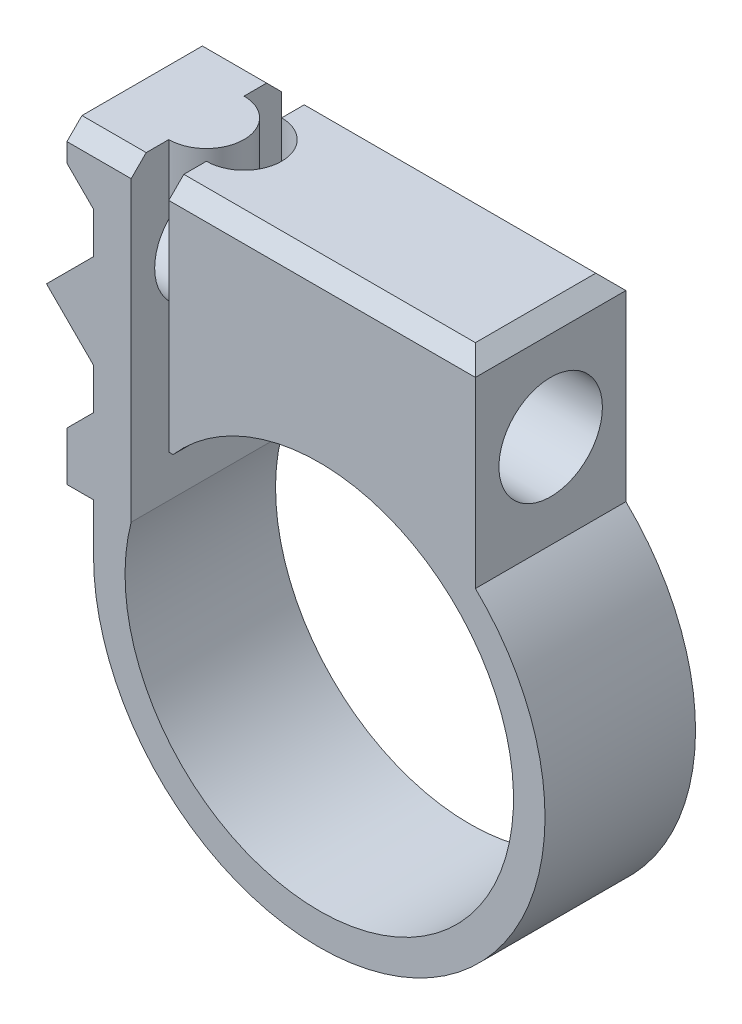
ISO-10303-21;
HEADER;
FILE_DESCRIPTION(('STEP AP214'),'2;1');
FILE_NAME('part.step','',(''),(''),'','','');
FILE_SCHEMA(('AUTOMOTIVE_DESIGN { 1 0 10303 214 1 1 1 1 }'));
ENDSEC;
DATA;
#1=APPLICATION_CONTEXT('core data for automotive mechanical design processes');
#2=APPLICATION_PROTOCOL_DEFINITION('international standard','automotive_design',2000,#1);
#3=PRODUCT_CONTEXT('',#1,'mechanical');
#4=PRODUCT('Part','Part','',(#3));
#5=PRODUCT_RELATED_PRODUCT_CATEGORY('part','',(#4));
#6=PRODUCT_DEFINITION_FORMATION('','',#4);
#7=PRODUCT_DEFINITION_CONTEXT('part definition',#1,'design');
#8=PRODUCT_DEFINITION('design','',#6,#7);
#9=PRODUCT_DEFINITION_SHAPE('','',#8);
#10=(LENGTH_UNIT() NAMED_UNIT(*) SI_UNIT(.MILLI.,.METRE.));
#11=(NAMED_UNIT(*) PLANE_ANGLE_UNIT() SI_UNIT($,.RADIAN.));
#12=(NAMED_UNIT(*) SI_UNIT($,.STERADIAN.) SOLID_ANGLE_UNIT());
#13=UNCERTAINTY_MEASURE_WITH_UNIT(LENGTH_MEASURE(1.E-05),#10,'distance_accuracy_value','');
#14=(GEOMETRIC_REPRESENTATION_CONTEXT(3) GLOBAL_UNCERTAINTY_ASSIGNED_CONTEXT((#13)) GLOBAL_UNIT_ASSIGNED_CONTEXT((#10,
#11,#12)) REPRESENTATION_CONTEXT('',''));
#15=CARTESIAN_POINT('',(0.,0.,0.));
#16=DIRECTION('',(0.,0.,1.));
#17=DIRECTION('',(1.,0.,0.));
#18=AXIS2_PLACEMENT_3D('',#15,#16,#17);
#19=CARTESIAN_POINT('',(-3.49250000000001,1.89597438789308,-34.0467024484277));
#20=DIRECTION('',(0.,1.,0.));
#21=DIRECTION('',(-1.,0.,0.));
#22=AXIS2_PLACEMENT_3D('',#19,#20,#21);
#23=CYLINDRICAL_SURFACE('',#22,2.54);
#24=DIRECTION('',(0.,1.,0.));
#25=VECTOR('',#24,1.);
#26=CARTESIAN_POINT('',(-3.4925,1.89597438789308,-36.5867024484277));
#27=LINE('',#26,#25);
#28=CARTESIAN_POINT('',(-3.49249999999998,1.89597438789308,-36.5867024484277));
#29=VERTEX_POINT('',#28);
#30=CARTESIAN_POINT('',(-3.49249999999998,4.05497438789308,-36.5867024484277));
#31=VERTEX_POINT('',#30);
#32=EDGE_CURVE('E275',#29,#31,#27,.T.);
#33=ORIENTED_EDGE('',*,*,#32,.T.);
#34=CARTESIAN_POINT('',(-3.49250000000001,4.05497438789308,-34.0467024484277));
#35=DIRECTION('',(0.,1.,0.));
#36=DIRECTION('',(-1.,0.,0.));
#37=AXIS2_PLACEMENT_3D('',#34,#35,#36);
#38=CIRCLE('',#37,2.54);
#39=CARTESIAN_POINT('',(-3.49250000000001,4.05497438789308,-31.5067024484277));
#40=VERTEX_POINT('',#39);
#41=EDGE_CURVE('E267',#40,#31,#38,.T.);
#42=ORIENTED_EDGE('',*,*,#41,.F.);
#43=DIRECTION('',(0.,1.,0.));
#44=VECTOR('',#43,1.);
#45=CARTESIAN_POINT('',(-3.49250000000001,1.89597438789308,-31.5067024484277));
#46=LINE('',#45,#44);
#47=CARTESIAN_POINT('',(-3.4925,1.89597438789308,-31.5067024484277));
#48=VERTEX_POINT('',#47);
#49=EDGE_CURVE('E277',#48,#40,#46,.T.);
#50=ORIENTED_EDGE('',*,*,#49,.F.);
#51=CARTESIAN_POINT('',(-3.49250000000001,1.89597438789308,-34.0467024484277));
#52=DIRECTION('',(0.,1.,0.));
#53=DIRECTION('',(1.,0.,0.));
#54=AXIS2_PLACEMENT_3D('',#51,#52,#53);
#55=CIRCLE('',#54,2.54);
#56=EDGE_CURVE('E282',#48,#29,#55,.T.);
#57=ORIENTED_EDGE('',*,*,#56,.T.);
#58=EDGE_LOOP('',(#33,#42,#50,#57));
#59=FACE_BOUND('',#58,.T.);
#60=ADVANCED_FACE('F53',(#59),#23,.T.);
#61=CARTESIAN_POINT('',(-3.49250000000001,11.0653743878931,-34.0467024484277));
#62=DIRECTION('',(0.,1.,0.));
#63=DIRECTION('',(-1.,0.,0.));
#64=AXIS2_PLACEMENT_3D('',#61,#62,#63);
#65=CIRCLE('',#64,2.54);
#66=CARTESIAN_POINT('',(-3.49250000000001,11.0653743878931,-31.5067024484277));
#67=VERTEX_POINT('',#66);
#68=CARTESIAN_POINT('',(-3.49249999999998,11.0653743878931,-36.5867024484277));
#69=VERTEX_POINT('',#68);
#70=EDGE_CURVE('E1064',#67,#69,#65,.T.);
#71=ORIENTED_EDGE('',*,*,#70,.T.);
#72=CARTESIAN_POINT('',(-3.49249999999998,14.5959743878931,-36.5867024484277));
#73=VERTEX_POINT('',#72);
#74=EDGE_CURVE('E285',#69,#73,#27,.T.);
#75=ORIENTED_EDGE('',*,*,#74,.T.);
#76=CARTESIAN_POINT('',(-3.49250000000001,14.5959743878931,-34.0467024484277));
#77=DIRECTION('',(0.,1.,0.));
#78=DIRECTION('',(1.,0.,0.));
#79=AXIS2_PLACEMENT_3D('',#76,#77,#78);
#80=CIRCLE('',#79,2.54);
#81=CARTESIAN_POINT('',(-3.49250000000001,14.5959743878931,-31.5067024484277));
#82=VERTEX_POINT('',#81);
#83=EDGE_CURVE('E279',#82,#73,#80,.T.);
#84=ORIENTED_EDGE('',*,*,#83,.F.);
#85=EDGE_CURVE('E284',#67,#82,#46,.T.);
#86=ORIENTED_EDGE('',*,*,#85,.F.);
#87=EDGE_LOOP('',(#71,#75,#84,#86));
#88=FACE_BOUND('',#87,.T.);
#89=ADVANCED_FACE('F374',(#88),#23,.T.);
#90=CARTESIAN_POINT('',(-6.03250000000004,7.75067438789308,-19.3271866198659));
#91=DIRECTION('',(0.707106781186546,-0.707106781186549,0.));
#92=DIRECTION('',(0.707106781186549,0.707106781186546,0.));
#93=AXIS2_PLACEMENT_3D('',#90,#91,#92);
#94=PLANE('',#93);
#95=DIRECTION('',(0.,0.,-1.));
#96=VECTOR('',#95,1.);
#97=CARTESIAN_POINT('',(-9.20750000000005,4.57567438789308,-19.3271866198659));
#98=LINE('',#97,#96);
#99=CARTESIAN_POINT('',(-9.20750000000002,4.57567438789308,-28.9667024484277));
#100=VERTEX_POINT('',#99);
#101=CARTESIAN_POINT('',(-9.20750000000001,4.57567438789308,-32.2267478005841));
#102=VERTEX_POINT('',#101);
#103=EDGE_CURVE('E921',#100,#102,#98,.T.);
#104=ORIENTED_EDGE('',*,*,#103,.F.);
#105=DIRECTION('',(0.707106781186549,0.707106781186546,0.));
#106=VECTOR('',#105,1.);
#107=CARTESIAN_POINT('',(-6.03250000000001,7.75067438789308,-28.9667024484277));
#108=LINE('',#107,#106);
#109=CARTESIAN_POINT('',(-6.03250000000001,7.75067438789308,-28.9667024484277));
#110=VERTEX_POINT('',#109);
#111=EDGE_CURVE('E842',#100,#110,#108,.T.);
#112=ORIENTED_EDGE('',*,*,#111,.T.);
#113=DIRECTION('',(0.,0.,-1.));
#114=VECTOR('',#113,1.);
#115=CARTESIAN_POINT('',(-6.03250000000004,7.75067438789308,-19.3271866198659));
#116=LINE('',#115,#114);
#117=CARTESIAN_POINT('',(-6.0325,7.75067438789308,-30.5596044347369));
#118=VERTEX_POINT('',#117);
#119=EDGE_CURVE('E913',#110,#118,#116,.T.);
#120=ORIENTED_EDGE('',*,*,#119,.T.);
#121=CARTESIAN_POINT('',(-6.22667438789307,7.5565,-34.0467024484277));
#122=DIRECTION('',(0.707106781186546,-0.707106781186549,0.));
#123=DIRECTION('',(0.707106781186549,0.707106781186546,0.));
#124=AXIS2_PLACEMENT_3D('',#121,#122,#123);
#125=ELLIPSE('',#124,4.93914086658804,3.4925);
#126=EDGE_CURVE('E968',#118,#102,#125,.T.);
#127=ORIENTED_EDGE('',*,*,#126,.T.);
#128=EDGE_LOOP('',(#104,#112,#120,#127));
#129=FACE_BOUND('',#128,.T.);
#130=ADVANCED_FACE('F378',(#129),#94,.F.);
#131=CARTESIAN_POINT('',(-6.03250000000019,10.5229487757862,22.920435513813));
#132=DIRECTION('',(1.,0.,0.));
#133=DIRECTION('',(0.,1.,0.));
#134=AXIS2_PLACEMENT_3D('',#131,#132,#133);
#135=PLANE('',#134);
#136=DIRECTION('',(0.,0.,-1.));
#137=VECTOR('',#136,1.);
#138=CARTESIAN_POINT('',(-6.03250000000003,-1.3716,-23.8867024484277));
#139=LINE('',#138,#137);
#140=CARTESIAN_POINT('',(-6.03250000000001,-1.3716,-28.9667024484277));
#141=VERTEX_POINT('',#140);
#142=CARTESIAN_POINT('',(-6.03249999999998,-1.3716,-39.1267024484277));
#143=VERTEX_POINT('',#142);
#144=EDGE_CURVE('E940',#141,#143,#139,.T.);
#145=ORIENTED_EDGE('',*,*,#144,.F.);
#146=DIRECTION('',(0.,1.,0.));
#147=VECTOR('',#146,1.);
#148=CARTESIAN_POINT('',(-6.03250000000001,10.5229487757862,-28.9667024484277));
#149=LINE('',#148,#147);
#150=CARTESIAN_POINT('',(-6.03250000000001,1.40067438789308,-28.9667024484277));
#151=VERTEX_POINT('',#150);
#152=EDGE_CURVE('E834',#141,#151,#149,.T.);
#153=ORIENTED_EDGE('',*,*,#152,.T.);
#154=DIRECTION('',(0.,0.,-1.));
#155=VECTOR('',#154,1.);
#156=CARTESIAN_POINT('',(-6.03250000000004,1.40067438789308,-19.3271866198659));
#157=LINE('',#156,#155);
#158=CARTESIAN_POINT('',(-6.03249999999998,1.40067438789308,-39.1267024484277));
#159=VERTEX_POINT('',#158);
#160=EDGE_CURVE('E916',#151,#159,#157,.T.);
#161=ORIENTED_EDGE('',*,*,#160,.T.);
#162=DIRECTION('',(0.,-1.,0.));
#163=VECTOR('',#162,1.);
#164=CARTESIAN_POINT('',(-6.03249999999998,10.5229487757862,-39.1267024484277));
#165=LINE('',#164,#163);
#166=EDGE_CURVE('E776',#159,#143,#165,.T.);
#167=ORIENTED_EDGE('',*,*,#166,.T.);
#168=EDGE_LOOP('',(#145,#153,#161,#167));
#169=FACE_BOUND('',#168,.T.);
#170=ADVANCED_FACE('F534',(#169),#135,.F.);
#171=ORIENTED_EDGE('',*,*,#119,.F.);
#172=DIRECTION('',(0.,1.,0.));
#173=VECTOR('',#172,1.);
#174=CARTESIAN_POINT('',(-6.03250000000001,10.5229487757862,-28.9667024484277));
#175=LINE('',#174,#173);
#176=CARTESIAN_POINT('',(-6.03250000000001,10.5229487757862,-28.9667024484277));
#177=VERTEX_POINT('',#176);
#178=EDGE_CURVE('E846',#110,#177,#175,.T.);
#179=ORIENTED_EDGE('',*,*,#178,.T.);
#180=DIRECTION('',(0.,0.,-1.));
#181=VECTOR('',#180,1.);
#182=CARTESIAN_POINT('',(-6.03250000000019,10.5229487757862,22.920435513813));
#183=LINE('',#182,#181);
#184=CARTESIAN_POINT('',(-6.0325,10.5229487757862,-32.2034070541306));
#185=VERTEX_POINT('',#184);
#186=EDGE_CURVE('E953',#177,#185,#183,.T.);
#187=ORIENTED_EDGE('',*,*,#186,.T.);
#188=CARTESIAN_POINT('',(-6.03249999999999,7.5565,-34.0467024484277));
#189=DIRECTION('',(1.,0.,0.));
#190=DIRECTION('',(0.,1.,0.));
#191=AXIS2_PLACEMENT_3D('',#188,#189,#190);
#192=CIRCLE('',#191,3.4925);
#193=EDGE_CURVE('E902',#185,#118,#192,.T.);
#194=ORIENTED_EDGE('',*,*,#193,.T.);
#195=EDGE_LOOP('',(#171,#179,#187,#194));
#196=FACE_BOUND('',#195,.T.);
#197=ADVANCED_FACE('F566',(#196),#135,.F.);
#198=CARTESIAN_POINT('',(-6.03249999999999,10.5229487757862,-35.8899978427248));
#199=VERTEX_POINT('',#198);
#200=CARTESIAN_POINT('',(-6.03249999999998,10.5229487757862,-39.1267024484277));
#201=VERTEX_POINT('',#200);
#202=EDGE_CURVE('E952',#199,#201,#183,.T.);
#203=ORIENTED_EDGE('',*,*,#202,.T.);
#204=DIRECTION('',(0.,-1.,0.));
#205=VECTOR('',#204,1.);
#206=CARTESIAN_POINT('',(-6.03249999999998,10.5229487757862,-39.1267024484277));
#207=LINE('',#206,#205);
#208=CARTESIAN_POINT('',(-6.03249999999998,7.75067438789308,-39.1267024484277));
#209=VERTEX_POINT('',#208);
#210=EDGE_CURVE('E788',#201,#209,#207,.T.);
#211=ORIENTED_EDGE('',*,*,#210,.T.);
#212=CARTESIAN_POINT('',(-6.03249999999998,7.75067438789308,-37.5338004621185));
#213=VERTEX_POINT('',#212);
#214=EDGE_CURVE('E912',#213,#209,#116,.T.);
#215=ORIENTED_EDGE('',*,*,#214,.F.);
#216=CARTESIAN_POINT('',(-6.03249999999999,7.5565,-34.0467024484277));
#217=DIRECTION('',(1.,0.,0.));
#218=DIRECTION('',(0.,1.,0.));
#219=AXIS2_PLACEMENT_3D('',#216,#217,#218);
#220=CIRCLE('',#219,3.4925);
#221=EDGE_CURVE('E894',#213,#199,#220,.T.);
#222=ORIENTED_EDGE('',*,*,#221,.T.);
#223=EDGE_LOOP('',(#203,#211,#215,#222));
#224=FACE_BOUND('',#223,.T.);
#225=ADVANCED_FACE('F535',(#224),#135,.F.);
#226=CARTESIAN_POINT('',(-3.49250000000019,-9.76922715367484,22.9204355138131));
#227=DIRECTION('',(-1.,0.,0.));
#228=DIRECTION('',(0.,0.,1.));
#229=AXIS2_PLACEMENT_3D('',#226,#227,#228);
#230=PLANE('',#229);
#231=DIRECTION('',(0.,0.,1.));
#232=VECTOR('',#231,1.);
#233=CARTESIAN_POINT('',(-3.49249999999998,11.0653743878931,-36.5867024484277));
#234=LINE('',#233,#232);
#235=EDGE_CURVE('E272',#69,#67,#234,.T.);
#236=ORIENTED_EDGE('',*,*,#235,.T.);
#237=ORIENTED_EDGE('',*,*,#85,.T.);
#238=DIRECTION('',(0.,0.,1.));
#239=VECTOR('',#238,1.);
#240=CARTESIAN_POINT('',(-3.49250000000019,14.5959743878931,22.9204355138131));
#241=LINE('',#240,#239);
#242=CARTESIAN_POINT('',(-3.49250000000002,14.5959743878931,-29.9827024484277));
#243=VERTEX_POINT('',#242);
#244=EDGE_CURVE('E880',#82,#243,#241,.T.);
#245=ORIENTED_EDGE('',*,*,#244,.T.);
#246=DIRECTION('',(0.,-0.707106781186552,0.707106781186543));
#247=VECTOR('',#246,1.);
#248=CARTESIAN_POINT('',(-3.49250000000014,-24.0381953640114,8.65146730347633));
#249=LINE('',#248,#247);
#250=CARTESIAN_POINT('',(-3.49250000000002,13.5799743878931,-28.9667024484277));
#251=VERTEX_POINT('',#250);
#252=EDGE_CURVE('E736',#243,#251,#249,.T.);
#253=ORIENTED_EDGE('',*,*,#252,.T.);
#254=DIRECTION('',(0.,-1.,0.));
#255=VECTOR('',#254,1.);
#256=CARTESIAN_POINT('',(-3.49250000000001,-9.76922715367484,-28.9667024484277));
#257=LINE('',#256,#255);
#258=CARTESIAN_POINT('',(-3.49250000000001,-6.50514802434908,-28.9667024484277));
#259=VERTEX_POINT('',#258);
#260=EDGE_CURVE('E858',#251,#259,#257,.T.);
#261=ORIENTED_EDGE('',*,*,#260,.T.);
#262=DIRECTION('',(0.,0.,-1.));
#263=VECTOR('',#262,1.);
#264=CARTESIAN_POINT('',(-3.49250000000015,-6.50514802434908,10.6617553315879));
#265=LINE('',#264,#263);
#266=CARTESIAN_POINT('',(-3.49249999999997,-6.50514802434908,-39.1267024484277));
#267=VERTEX_POINT('',#266);
#268=EDGE_CURVE('E929',#267,#259,#265,.F.);
#269=ORIENTED_EDGE('',*,*,#268,.F.);
#270=DIRECTION('',(0.,1.,0.));
#271=VECTOR('',#270,1.);
#272=CARTESIAN_POINT('',(-3.49249999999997,-9.76922715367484,-39.1267024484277));
#273=LINE('',#272,#271);
#274=CARTESIAN_POINT('',(-3.49249999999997,13.5799743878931,-39.1267024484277));
#275=VERTEX_POINT('',#274);
#276=EDGE_CURVE('E799',#267,#275,#273,.T.);
#277=ORIENTED_EDGE('',*,*,#276,.T.);
#278=DIRECTION('',(0.,0.707106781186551,0.707106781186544));
#279=VECTOR('',#278,1.);
#280=CARTESIAN_POINT('',(-3.49250000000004,32.9289425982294,-19.7777342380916));
#281=LINE('',#280,#279);
#282=CARTESIAN_POINT('',(-3.49249999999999,14.5959743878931,-38.1107024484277));
#283=VERTEX_POINT('',#282);
#284=EDGE_CURVE('E751',#275,#283,#281,.T.);
#285=ORIENTED_EDGE('',*,*,#284,.T.);
#286=EDGE_CURVE('E881',#283,#73,#241,.T.);
#287=ORIENTED_EDGE('',*,*,#286,.T.);
#288=ORIENTED_EDGE('',*,*,#74,.F.);
#289=EDGE_LOOP('',(#236,#237,#245,#253,#261,#269,#277,#285,#287,#288));
#290=FACE_BOUND('',#289,.T.);
#291=CARTESIAN_POINT('',(-3.49249999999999,7.5565,-34.0467024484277));
#292=DIRECTION('',(-1.,0.,0.));
#293=DIRECTION('',(0.,0.,1.));
#294=AXIS2_PLACEMENT_3D('',#291,#292,#293);
#295=CIRCLE('',#294,3.4925);
#296=CARTESIAN_POINT('',(-3.4925,7.5565,-30.5542024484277));
#297=VERTEX_POINT('',#296);
#298=EDGE_CURVE('E908',#297,#297,#295,.T.);
#299=ORIENTED_EDGE('',*,*,#298,.T.);
#300=EDGE_LOOP('',(#299));
#301=FACE_BOUND('',#300,.T.);
#302=ORIENTED_EDGE('',*,*,#49,.T.);
#303=DIRECTION('',(0.,0.,1.));
#304=VECTOR('',#303,1.);
#305=CARTESIAN_POINT('',(-3.49249999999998,4.05497438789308,-36.5867024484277));
#306=LINE('',#305,#304);
#307=EDGE_CURVE('E68',#31,#40,#306,.T.);
#308=ORIENTED_EDGE('',*,*,#307,.F.);
#309=ORIENTED_EDGE('',*,*,#32,.F.);
#310=DIRECTION('',(0.,0.,1.));
#311=VECTOR('',#310,1.);
#312=CARTESIAN_POINT('',(-3.49250000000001,1.89597438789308,-31.5067024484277));
#313=LINE('',#312,#311);
#314=EDGE_CURVE('E76',#29,#48,#313,.T.);
#315=ORIENTED_EDGE('',*,*,#314,.T.);
#316=EDGE_LOOP('',(#302,#308,#309,#315));
#317=FACE_BOUND('',#316,.T.);
#318=ADVANCED_FACE('F274',(#290,#301,#317),#230,.F.);
#319=CARTESIAN_POINT('',(-0.104111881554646,-1.13303099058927,22.9204355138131));
#320=DIRECTION('',(-0.00227071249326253,0.999997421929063,0.));
#321=DIRECTION('',(0.,0.,-1.));
#322=AXIS2_PLACEMENT_3D('',#319,#320,#321);
#323=PLANE('',#322);
#324=DIRECTION('',(-0.999997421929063,-0.00227071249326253,0.));
#325=VECTOR('',#324,1.);
#326=CARTESIAN_POINT('',(-0.104111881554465,-1.13303099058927,-28.9667024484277));
#327=LINE('',#326,#325);
#328=CARTESIAN_POINT('',(-0.952500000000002,-1.13495744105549,-28.9667024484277));
#329=VERTEX_POINT('',#328);
#330=CARTESIAN_POINT('',(-0.660739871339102,-1.13429493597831,-28.9667024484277));
#331=VERTEX_POINT('',#330);
#332=EDGE_CURVE('E865',#329,#331,#327,.F.);
#333=ORIENTED_EDGE('',*,*,#332,.F.);
#334=DIRECTION('',(0.,0.,1.));
#335=VECTOR('',#334,1.);
#336=CARTESIAN_POINT('',(-0.952500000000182,-1.13495744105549,22.9204355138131));
#337=LINE('',#336,#335);
#338=CARTESIAN_POINT('',(-0.952499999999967,-1.13495744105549,-39.1267024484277));
#339=VERTEX_POINT('',#338);
#340=EDGE_CURVE('E956',#339,#329,#337,.T.);
#341=ORIENTED_EDGE('',*,*,#340,.F.);
#342=DIRECTION('',(0.999997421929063,0.00227071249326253,0.));
#343=VECTOR('',#342,1.);
#344=CARTESIAN_POINT('',(-0.104111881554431,-1.13303099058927,-39.1267024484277));
#345=LINE('',#344,#343);
#346=CARTESIAN_POINT('',(-0.660739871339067,-1.13429493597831,-39.1267024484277));
#347=VERTEX_POINT('',#346);
#348=EDGE_CURVE('E806',#347,#339,#345,.F.);
#349=ORIENTED_EDGE('',*,*,#348,.F.);
#350=DIRECTION('',(0.,0.,-1.));
#351=VECTOR('',#350,1.);
#352=CARTESIAN_POINT('',(-0.660739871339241,-1.13429493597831,10.6617553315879));
#353=LINE('',#352,#351);
#354=EDGE_CURVE('E960',#347,#331,#353,.F.);
#355=ORIENTED_EDGE('',*,*,#354,.T.);
#356=EDGE_LOOP('',(#333,#341,#349,#355));
#357=FACE_BOUND('',#356,.T.);
#358=ADVANCED_FACE('F542',(#357),#323,.F.);
#359=CARTESIAN_POINT('',(9.20749999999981,-9.76922715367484,22.9204355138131));
#360=DIRECTION('',(0.,0.,-1.));
#361=DIRECTION('',(-1.,0.,0.));
#362=AXIS2_PLACEMENT_3D('',#359,#360,#361);
#363=CYLINDRICAL_SURFACE('',#362,15.24);
#364=CARTESIAN_POINT('',(9.20749999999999,-9.76922715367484,-28.9667024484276));
#365=DIRECTION('',(0.,0.,-1.));
#366=DIRECTION('',(-1.,0.,0.));
#367=AXIS2_PLACEMENT_3D('',#364,#365,#366);
#368=CIRCLE('',#367,15.24);
#369=CARTESIAN_POINT('',(19.7485,1.23735810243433,-28.9667024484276));
#370=VERTEX_POINT('',#369);
#371=CARTESIAN_POINT('',(-6.03250000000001,-9.76922715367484,-28.9667024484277));
#372=VERTEX_POINT('',#371);
#373=EDGE_CURVE('E817',#370,#372,#368,.T.);
#374=ORIENTED_EDGE('',*,*,#373,.T.);
#375=DIRECTION('',(0.,0.,-1.));
#376=VECTOR('',#375,1.);
#377=CARTESIAN_POINT('',(-6.03250000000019,-9.76922715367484,22.920435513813));
#378=LINE('',#377,#376);
#379=CARTESIAN_POINT('',(-6.03249999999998,-9.76922715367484,-39.1267024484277));
#380=VERTEX_POINT('',#379);
#381=EDGE_CURVE('E948',#372,#380,#378,.T.);
#382=ORIENTED_EDGE('',*,*,#381,.T.);
#383=CARTESIAN_POINT('',(9.20750000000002,-9.76922715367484,-39.1267024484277));
#384=DIRECTION('',(0.,0.,1.));
#385=DIRECTION('',(1.,0.,0.));
#386=AXIS2_PLACEMENT_3D('',#383,#384,#385);
#387=CIRCLE('',#386,15.24);
#388=CARTESIAN_POINT('',(19.7485,1.23735810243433,-39.1267024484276));
#389=VERTEX_POINT('',#388);
#390=EDGE_CURVE('E759',#380,#389,#387,.T.);
#391=ORIENTED_EDGE('',*,*,#390,.T.);
#392=DIRECTION('',(0.,0.,-1.));
#393=VECTOR('',#392,1.);
#394=CARTESIAN_POINT('',(19.7484999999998,1.23735810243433,22.9204355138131));
#395=LINE('',#394,#393);
#396=EDGE_CURVE('E969',#389,#370,#395,.F.);
#397=ORIENTED_EDGE('',*,*,#396,.T.);
#398=EDGE_LOOP('',(#374,#382,#391,#397));
#399=FACE_BOUND('',#398,.T.);
#400=ADVANCED_FACE('F531',(#399),#363,.T.);
#401=ORIENTED_EDGE('',*,*,#381,.F.);
#402=DIRECTION('',(0.,1.,0.));
#403=VECTOR('',#402,1.);
#404=CARTESIAN_POINT('',(-6.03250000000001,10.5229487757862,-28.9667024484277));
#405=LINE('',#404,#403);
#406=CARTESIAN_POINT('',(-6.03250000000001,-6.46843918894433,-28.9667024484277));
#407=VERTEX_POINT('',#406);
#408=EDGE_CURVE('E820',#372,#407,#405,.T.);
#409=ORIENTED_EDGE('',*,*,#408,.T.);
#410=DIRECTION('',(0.,0.,1.));
#411=VECTOR('',#410,1.);
#412=CARTESIAN_POINT('',(-6.03249999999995,-6.46843918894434,-45.4244945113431));
#413=LINE('',#412,#411);
#414=CARTESIAN_POINT('',(-6.03249999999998,-6.46843918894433,-39.1267024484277));
#415=VERTEX_POINT('',#414);
#416=EDGE_CURVE('E925',#415,#407,#413,.T.);
#417=ORIENTED_EDGE('',*,*,#416,.F.);
#418=DIRECTION('',(0.,-1.,0.));
#419=VECTOR('',#418,1.);
#420=CARTESIAN_POINT('',(-6.03249999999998,10.5229487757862,-39.1267024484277));
#421=LINE('',#420,#419);
#422=EDGE_CURVE('E762',#415,#380,#421,.T.);
#423=ORIENTED_EDGE('',*,*,#422,.T.);
#424=EDGE_LOOP('',(#401,#409,#417,#423));
#425=FACE_BOUND('',#424,.T.);
#426=ADVANCED_FACE('F523',(#425),#135,.F.);
#427=CARTESIAN_POINT('',(-0.952500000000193,12.319,22.9204355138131));
#428=DIRECTION('',(1.,0.,0.));
#429=DIRECTION('',(0.,1.,0.));
#430=AXIS2_PLACEMENT_3D('',#427,#428,#429);
#431=PLANE('',#430);
#432=CARTESIAN_POINT('',(-0.952499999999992,7.5565,-34.0467024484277));
#433=DIRECTION('',(1.,0.,0.));
#434=DIRECTION('',(0.,1.,0.));
#435=AXIS2_PLACEMENT_3D('',#432,#433,#434);
#436=CIRCLE('',#435,3.4925);
#437=CARTESIAN_POINT('',(-0.952499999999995,5.15942756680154,-36.5867024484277));
#438=VERTEX_POINT('',#437);
#439=CARTESIAN_POINT('',(-0.952499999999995,9.95357243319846,-36.5867024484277));
#440=VERTEX_POINT('',#439);
#441=EDGE_CURVE('E712',#438,#440,#436,.T.);
#442=ORIENTED_EDGE('',*,*,#441,.T.);
#443=DIRECTION('',(0.,1.,0.));
#444=VECTOR('',#443,1.);
#445=CARTESIAN_POINT('',(-0.952499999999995,1.26097438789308,-36.5867024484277));
#446=LINE('',#445,#444);
#447=CARTESIAN_POINT('',(-0.952499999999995,14.5959743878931,-36.5867024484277));
#448=VERTEX_POINT('',#447);
#449=EDGE_CURVE('E301',#440,#448,#446,.T.);
#450=ORIENTED_EDGE('',*,*,#449,.T.);
#451=DIRECTION('',(0.,0.,-1.));
#452=VECTOR('',#451,1.);
#453=CARTESIAN_POINT('',(-0.952500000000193,14.5959743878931,22.9204355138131));
#454=LINE('',#453,#452);
#455=CARTESIAN_POINT('',(-0.952499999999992,14.5959743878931,-38.1107024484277));
#456=VERTEX_POINT('',#455);
#457=EDGE_CURVE('E885',#448,#456,#454,.T.);
#458=ORIENTED_EDGE('',*,*,#457,.T.);
#459=DIRECTION('',(0.,-0.707106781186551,-0.707106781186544));
#460=VECTOR('',#459,1.);
#461=CARTESIAN_POINT('',(-0.952500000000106,43.9730561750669,-8.73362066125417));
#462=LINE('',#461,#460);
#463=CARTESIAN_POINT('',(-0.952499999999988,13.5799743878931,-39.1267024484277));
#464=VERTEX_POINT('',#463);
#465=EDGE_CURVE('E747',#456,#464,#462,.T.);
#466=ORIENTED_EDGE('',*,*,#465,.T.);
#467=DIRECTION('',(0.,-1.,0.));
#468=VECTOR('',#467,1.);
#469=CARTESIAN_POINT('',(-0.952499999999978,12.319,-39.1267024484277));
#470=LINE('',#469,#468);
#471=EDGE_CURVE('E810',#464,#339,#470,.T.);
#472=ORIENTED_EDGE('',*,*,#471,.T.);
#473=ORIENTED_EDGE('',*,*,#340,.T.);
#474=DIRECTION('',(0.,1.,0.));
#475=VECTOR('',#474,1.);
#476=CARTESIAN_POINT('',(-0.952500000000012,12.319,-28.9667024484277));
#477=LINE('',#476,#475);
#478=CARTESIAN_POINT('',(-0.952500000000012,13.5799743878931,-28.9667024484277));
#479=VERTEX_POINT('',#478);
#480=EDGE_CURVE('E868',#329,#479,#477,.T.);
#481=ORIENTED_EDGE('',*,*,#480,.T.);
#482=DIRECTION('',(0.,0.707106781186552,-0.707106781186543));
#483=VECTOR('',#482,1.);
#484=CARTESIAN_POINT('',(-0.952500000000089,-12.9940817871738,-2.39264627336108));
#485=LINE('',#484,#483);
#486=CARTESIAN_POINT('',(-0.952500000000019,14.5959743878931,-29.9827024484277));
#487=VERTEX_POINT('',#486);
#488=EDGE_CURVE('E732',#479,#487,#485,.T.);
#489=ORIENTED_EDGE('',*,*,#488,.T.);
#490=CARTESIAN_POINT('',(-0.952500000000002,14.5959743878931,-31.5067024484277));
#491=VERTEX_POINT('',#490);
#492=EDGE_CURVE('E886',#487,#491,#454,.T.);
#493=ORIENTED_EDGE('',*,*,#492,.T.);
#494=DIRECTION('',(0.,1.,0.));
#495=VECTOR('',#494,1.);
#496=CARTESIAN_POINT('',(-0.952500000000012,1.26097438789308,-31.5067024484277));
#497=LINE('',#496,#495);
#498=CARTESIAN_POINT('',(-0.952500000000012,9.95357243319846,-31.5067024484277));
#499=VERTEX_POINT('',#498);
#500=EDGE_CURVE('E308',#499,#491,#497,.T.);
#501=ORIENTED_EDGE('',*,*,#500,.F.);
#502=CARTESIAN_POINT('',(-0.952499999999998,5.15942756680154,-31.5067024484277));
#503=VERTEX_POINT('',#502);
#504=EDGE_CURVE('E709',#499,#503,#436,.T.);
#505=ORIENTED_EDGE('',*,*,#504,.T.);
#506=CARTESIAN_POINT('',(-0.952500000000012,1.26097438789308,-31.5067024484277));
#507=VERTEX_POINT('',#506);
#508=EDGE_CURVE('E304',#507,#503,#497,.T.);
#509=ORIENTED_EDGE('',*,*,#508,.F.);
#510=DIRECTION('',(0.,0.,1.));
#511=VECTOR('',#510,1.);
#512=CARTESIAN_POINT('',(-0.952500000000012,1.26097438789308,-31.5067024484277));
#513=LINE('',#512,#511);
#514=CARTESIAN_POINT('',(-0.952499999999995,1.26097438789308,-36.5867024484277));
#515=VERTEX_POINT('',#514);
#516=EDGE_CURVE('E296',#515,#507,#513,.T.);
#517=ORIENTED_EDGE('',*,*,#516,.F.);
#518=EDGE_CURVE('E309',#515,#438,#446,.T.);
#519=ORIENTED_EDGE('',*,*,#518,.T.);
#520=EDGE_LOOP('',(#442,#450,#458,#466,#472,#473,#481,#489,#493,#501,#505,#509,#517,#519));
#521=FACE_BOUND('',#520,.T.);
#522=ADVANCED_FACE('F513',(#521),#431,.F.);
#523=CARTESIAN_POINT('',(-6.03250000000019,10.5229487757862,22.920435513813));
#524=DIRECTION('',(0.707106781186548,0.707106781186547,0.));
#525=DIRECTION('',(-0.707106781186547,0.707106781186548,0.));
#526=AXIS2_PLACEMENT_3D('',#523,#524,#525);
#527=PLANE('',#526);
#528=ORIENTED_EDGE('',*,*,#186,.F.);
#529=DIRECTION('',(-0.707106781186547,0.707106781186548,0.));
#530=VECTOR('',#529,1.);
#531=CARTESIAN_POINT('',(-6.03250000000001,10.5229487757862,-28.9667024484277));
#532=LINE('',#531,#530);
#533=CARTESIAN_POINT('',(-7.82855122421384,12.319,-28.9667024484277));
#534=VERTEX_POINT('',#533);
#535=EDGE_CURVE('E850',#177,#534,#532,.T.);
#536=ORIENTED_EDGE('',*,*,#535,.T.);
#537=DIRECTION('',(0.,0.,-1.));
#538=VECTOR('',#537,1.);
#539=CARTESIAN_POINT('',(-7.82855122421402,12.319,22.920435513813));
#540=LINE('',#539,#538);
#541=CARTESIAN_POINT('',(-7.82855122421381,12.319,-39.1267024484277));
#542=VERTEX_POINT('',#541);
#543=EDGE_CURVE('E944',#534,#542,#540,.T.);
#544=ORIENTED_EDGE('',*,*,#543,.T.);
#545=DIRECTION('',(0.707106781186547,-0.707106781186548,0.));
#546=VECTOR('',#545,1.);
#547=CARTESIAN_POINT('',(-6.03249999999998,10.5229487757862,-39.1267024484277));
#548=LINE('',#547,#546);
#549=EDGE_CURVE('E792',#542,#201,#548,.T.);
#550=ORIENTED_EDGE('',*,*,#549,.T.);
#551=ORIENTED_EDGE('',*,*,#202,.F.);
#552=CARTESIAN_POINT('',(-3.06605122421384,7.5565,-34.0467024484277));
#553=DIRECTION('',(0.707106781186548,0.707106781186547,0.));
#554=DIRECTION('',(0.707106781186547,-0.707106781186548,0.));
#555=AXIS2_PLACEMENT_3D('',#552,#553,#554);
#556=ELLIPSE('',#555,4.93914086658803,3.4925);
#557=EDGE_CURVE('E898',#199,#185,#556,.T.);
#558=ORIENTED_EDGE('',*,*,#557,.T.);
#559=EDGE_LOOP('',(#528,#536,#544,#550,#551,#558));
#560=FACE_BOUND('',#559,.T.);
#561=ADVANCED_FACE('F504',(#560),#527,.F.);
#562=CARTESIAN_POINT('',(-6.03250000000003,-1.3716,-23.8867024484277));
#563=DIRECTION('',(0.707106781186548,-0.707106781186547,0.));
#564=DIRECTION('',(0.707106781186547,0.707106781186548,0.));
#565=AXIS2_PLACEMENT_3D('',#562,#563,#564);
#566=PLANE('',#565);
#567=DIRECTION('',(0.,0.,-1.));
#568=VECTOR('',#567,1.);
#569=CARTESIAN_POINT('',(-7.82855122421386,-3.16765122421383,-23.8867024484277));
#570=LINE('',#569,#568);
#571=CARTESIAN_POINT('',(-7.82855122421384,-3.16765122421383,-28.9667024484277));
#572=VERTEX_POINT('',#571);
#573=CARTESIAN_POINT('',(-7.82855122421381,-3.16765122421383,-39.1267024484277));
#574=VERTEX_POINT('',#573);
#575=EDGE_CURVE('E936',#572,#574,#570,.T.);
#576=ORIENTED_EDGE('',*,*,#575,.F.);
#577=DIRECTION('',(0.707106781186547,0.707106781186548,0.));
#578=VECTOR('',#577,1.);
#579=CARTESIAN_POINT('',(-6.03250000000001,-1.3716,-28.9667024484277));
#580=LINE('',#579,#578);
#581=EDGE_CURVE('E830',#572,#141,#580,.T.);
#582=ORIENTED_EDGE('',*,*,#581,.T.);
#583=ORIENTED_EDGE('',*,*,#144,.T.);
#584=DIRECTION('',(-0.707106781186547,-0.707106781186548,0.));
#585=VECTOR('',#584,1.);
#586=CARTESIAN_POINT('',(-6.03249999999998,-1.3716,-39.1267024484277));
#587=LINE('',#586,#585);
#588=EDGE_CURVE('E772',#143,#574,#587,.T.);
#589=ORIENTED_EDGE('',*,*,#588,.T.);
#590=EDGE_LOOP('',(#576,#582,#583,#589));
#591=FACE_BOUND('',#590,.T.);
#592=ADVANCED_FACE('F495',(#591),#566,.F.);
#593=CARTESIAN_POINT('',(9.20749999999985,-9.76922715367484,10.6617553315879));
#594=DIRECTION('',(0.,0.,-1.));
#595=DIRECTION('',(-1.,0.,0.));
#596=AXIS2_PLACEMENT_3D('',#593,#594,#595);
#597=CYLINDRICAL_SURFACE('',#596,13.11275);
#598=CARTESIAN_POINT('',(9.20749999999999,-9.76922715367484,-28.9667024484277));
#599=DIRECTION('',(0.,0.,-1.));
#600=DIRECTION('',(-1.,0.,0.));
#601=AXIS2_PLACEMENT_3D('',#598,#599,#600);
#602=CIRCLE('',#601,13.11275);
#603=EDGE_CURVE('E861',#331,#259,#602,.T.);
#604=ORIENTED_EDGE('',*,*,#603,.F.);
#605=ORIENTED_EDGE('',*,*,#354,.F.);
#606=CARTESIAN_POINT('',(9.20750000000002,-9.76922715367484,-39.1267024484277));
#607=DIRECTION('',(0.,0.,1.));
#608=DIRECTION('',(1.,0.,0.));
#609=AXIS2_PLACEMENT_3D('',#606,#607,#608);
#610=CIRCLE('',#609,13.11275);
#611=EDGE_CURVE('E803',#267,#347,#610,.T.);
#612=ORIENTED_EDGE('',*,*,#611,.F.);
#613=ORIENTED_EDGE('',*,*,#268,.T.);
#614=EDGE_LOOP('',(#604,#605,#612,#613));
#615=FACE_BOUND('',#614,.T.);
#616=ADVANCED_FACE('F486',(#615),#597,.F.);
#617=CARTESIAN_POINT('',(-7.82855122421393,12.319,-3.12612307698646));
#618=DIRECTION('',(1.,0.,0.));
#619=DIRECTION('',(0.,0.,-1.));
#620=AXIS2_PLACEMENT_3D('',#617,#618,#619);
#621=PLANE('',#620);
#622=DIRECTION('',(0.,1.,0.));
#623=VECTOR('',#622,1.);
#624=CARTESIAN_POINT('',(-7.82855122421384,12.319,-28.9667024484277));
#625=LINE('',#624,#623);
#626=CARTESIAN_POINT('',(-7.82855122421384,13.5799743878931,-28.9667024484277));
#627=VERTEX_POINT('',#626);
#628=EDGE_CURVE('E854',#534,#627,#625,.T.);
#629=ORIENTED_EDGE('',*,*,#628,.T.);
#630=DIRECTION('',(0.,0.707106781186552,-0.707106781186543));
#631=VECTOR('',#630,1.);
#632=CARTESIAN_POINT('',(-7.82855122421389,0.0291975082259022,-15.4159255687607));
#633=LINE('',#632,#631);
#634=CARTESIAN_POINT('',(-7.82855122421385,14.5959743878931,-29.9827024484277));
#635=VERTEX_POINT('',#634);
#636=EDGE_CURVE('E727',#627,#635,#633,.T.);
#637=ORIENTED_EDGE('',*,*,#636,.T.);
#638=DIRECTION('',(0.,0.,-1.));
#639=VECTOR('',#638,1.);
#640=CARTESIAN_POINT('',(-7.82855122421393,14.5959743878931,-3.12612307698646));
#641=LINE('',#640,#639);
#642=CARTESIAN_POINT('',(-7.82855122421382,14.5959743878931,-38.1107024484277));
#643=VERTEX_POINT('',#642);
#644=EDGE_CURVE('E876',#635,#643,#641,.T.);
#645=ORIENTED_EDGE('',*,*,#644,.T.);
#646=DIRECTION('',(0.,-0.707106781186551,-0.707106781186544));
#647=VECTOR('',#646,1.);
#648=CARTESIAN_POINT('',(-7.82855122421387,30.9497768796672,-21.7568999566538));
#649=LINE('',#648,#647);
#650=CARTESIAN_POINT('',(-7.82855122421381,13.5799743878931,-39.1267024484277));
#651=VERTEX_POINT('',#650);
#652=EDGE_CURVE('E743',#643,#651,#649,.T.);
#653=ORIENTED_EDGE('',*,*,#652,.T.);
#654=DIRECTION('',(0.,-1.,0.));
#655=VECTOR('',#654,1.);
#656=CARTESIAN_POINT('',(-7.82855122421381,12.319,-39.1267024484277));
#657=LINE('',#656,#655);
#658=EDGE_CURVE('E796',#651,#542,#657,.T.);
#659=ORIENTED_EDGE('',*,*,#658,.T.);
#660=ORIENTED_EDGE('',*,*,#543,.F.);
#661=EDGE_LOOP('',(#629,#637,#645,#653,#659,#660));
#662=FACE_BOUND('',#661,.T.);
#663=ADVANCED_FACE('F477',(#662),#621,.F.);
#664=CARTESIAN_POINT('',(-7.82855122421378,-3.16765122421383,-45.4244945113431));
#665=DIRECTION('',(-1.,0.,0.));
#666=DIRECTION('',(0.,0.,1.));
#667=AXIS2_PLACEMENT_3D('',#664,#665,#666);
#668=PLANE('',#667);
#669=DIRECTION('',(0.,-1.,0.));
#670=VECTOR('',#669,1.);
#671=CARTESIAN_POINT('',(-7.82855122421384,-3.16765122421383,-28.9667024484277));
#672=LINE('',#671,#670);
#673=CARTESIAN_POINT('',(-7.82855122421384,-6.46843918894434,-28.9667024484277));
#674=VERTEX_POINT('',#673);
#675=EDGE_CURVE('E827',#572,#674,#672,.T.);
#676=ORIENTED_EDGE('',*,*,#675,.F.);
#677=ORIENTED_EDGE('',*,*,#575,.T.);
#678=DIRECTION('',(0.,1.,0.));
#679=VECTOR('',#678,1.);
#680=CARTESIAN_POINT('',(-7.82855122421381,-3.16765122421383,-39.1267024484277));
#681=LINE('',#680,#679);
#682=CARTESIAN_POINT('',(-7.82855122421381,-6.46843918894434,-39.1267024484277));
#683=VERTEX_POINT('',#682);
#684=EDGE_CURVE('E769',#683,#574,#681,.T.);
#685=ORIENTED_EDGE('',*,*,#684,.F.);
#686=DIRECTION('',(0.,0.,1.));
#687=VECTOR('',#686,1.);
#688=CARTESIAN_POINT('',(-7.82855122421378,-6.46843918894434,-45.4244945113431));
#689=LINE('',#688,#687);
#690=EDGE_CURVE('E924',#683,#674,#689,.T.);
#691=ORIENTED_EDGE('',*,*,#690,.T.);
#692=EDGE_LOOP('',(#676,#677,#685,#691));
#693=FACE_BOUND('',#692,.T.);
#694=ADVANCED_FACE('F468',(#693),#668,.T.);
#695=CARTESIAN_POINT('',(-7.82855122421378,-6.46843918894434,-45.4244945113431));
#696=DIRECTION('',(0.,-1.,0.));
#697=DIRECTION('',(1.,0.,0.));
#698=AXIS2_PLACEMENT_3D('',#695,#696,#697);
#699=PLANE('',#698);
#700=DIRECTION('',(1.,0.,0.));
#701=VECTOR('',#700,1.);
#702=CARTESIAN_POINT('',(-7.82855122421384,-6.46843918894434,-28.9667024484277));
#703=LINE('',#702,#701);
#704=EDGE_CURVE('E824',#674,#407,#703,.T.);
#705=ORIENTED_EDGE('',*,*,#704,.F.);
#706=ORIENTED_EDGE('',*,*,#690,.F.);
#707=DIRECTION('',(-1.,0.,0.));
#708=VECTOR('',#707,1.);
#709=CARTESIAN_POINT('',(-7.82855122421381,-6.46843918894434,-39.1267024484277));
#710=LINE('',#709,#708);
#711=EDGE_CURVE('E766',#415,#683,#710,.T.);
#712=ORIENTED_EDGE('',*,*,#711,.F.);
#713=ORIENTED_EDGE('',*,*,#416,.T.);
#714=EDGE_LOOP('',(#705,#706,#712,#713));
#715=FACE_BOUND('',#714,.T.);
#716=ADVANCED_FACE('F460',(#715),#699,.T.);
#717=CARTESIAN_POINT('',(-9.20750000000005,4.57567438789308,-19.3271866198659));
#718=DIRECTION('',(0.707106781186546,0.707106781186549,0.));
#719=DIRECTION('',(-0.707106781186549,0.707106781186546,0.));
#720=AXIS2_PLACEMENT_3D('',#717,#718,#719);
#721=PLANE('',#720);
#722=ORIENTED_EDGE('',*,*,#160,.F.);
#723=DIRECTION('',(-0.707106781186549,0.707106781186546,0.));
#724=VECTOR('',#723,1.);
#725=CARTESIAN_POINT('',(-9.20750000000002,4.57567438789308,-28.9667024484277));
#726=LINE('',#725,#724);
#727=EDGE_CURVE('E838',#151,#100,#726,.T.);
#728=ORIENTED_EDGE('',*,*,#727,.T.);
#729=ORIENTED_EDGE('',*,*,#103,.T.);
#730=CARTESIAN_POINT('',(-12.1883256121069,7.5565,-34.0467024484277));
#731=DIRECTION('',(0.707106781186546,0.707106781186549,0.));
#732=DIRECTION('',(0.707106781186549,-0.707106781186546,0.));
#733=AXIS2_PLACEMENT_3D('',#730,#731,#732);
#734=ELLIPSE('',#733,4.93914086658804,3.4925);
#735=CARTESIAN_POINT('',(-9.2075,4.57567438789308,-35.8666570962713));
#736=VERTEX_POINT('',#735);
#737=EDGE_CURVE('E890',#102,#736,#734,.T.);
#738=ORIENTED_EDGE('',*,*,#737,.T.);
#739=CARTESIAN_POINT('',(-9.20749999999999,4.57567438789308,-39.1267024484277));
#740=VERTEX_POINT('',#739);
#741=EDGE_CURVE('E920',#736,#740,#98,.T.);
#742=ORIENTED_EDGE('',*,*,#741,.T.);
#743=DIRECTION('',(0.707106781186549,-0.707106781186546,0.));
#744=VECTOR('',#743,1.);
#745=CARTESIAN_POINT('',(-9.20749999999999,4.57567438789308,-39.1267024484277));
#746=LINE('',#745,#744);
#747=EDGE_CURVE('E780',#740,#159,#746,.T.);
#748=ORIENTED_EDGE('',*,*,#747,.T.);
#749=EDGE_LOOP('',(#722,#728,#729,#738,#742,#748));
#750=FACE_BOUND('',#749,.T.);
#751=ADVANCED_FACE('F450',(#750),#721,.F.);
#752=ORIENTED_EDGE('',*,*,#214,.T.);
#753=DIRECTION('',(-0.707106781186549,-0.707106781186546,0.));
#754=VECTOR('',#753,1.);
#755=CARTESIAN_POINT('',(-6.03249999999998,7.75067438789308,-39.1267024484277));
#756=LINE('',#755,#754);
#757=EDGE_CURVE('E784',#209,#740,#756,.T.);
#758=ORIENTED_EDGE('',*,*,#757,.T.);
#759=ORIENTED_EDGE('',*,*,#741,.F.);
#760=EDGE_CURVE('E964',#736,#213,#125,.T.);
#761=ORIENTED_EDGE('',*,*,#760,.T.);
#762=EDGE_LOOP('',(#752,#758,#759,#761));
#763=FACE_BOUND('',#762,.T.);
#764=ADVANCED_FACE('F441',(#763),#94,.F.);
#765=CARTESIAN_POINT('',(-50.3491866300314,7.5565,-34.0467024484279));
#766=DIRECTION('',(1.,0.,0.));
#767=DIRECTION('',(0.,0.,-1.));
#768=AXIS2_PLACEMENT_3D('',#765,#766,#767);
#769=CYLINDRICAL_SURFACE('',#768,3.4925);
#770=ORIENTED_EDGE('',*,*,#557,.F.);
#771=ORIENTED_EDGE('',*,*,#221,.F.);
#772=ORIENTED_EDGE('',*,*,#760,.F.);
#773=ORIENTED_EDGE('',*,*,#737,.F.);
#774=ORIENTED_EDGE('',*,*,#126,.F.);
#775=ORIENTED_EDGE('',*,*,#193,.F.);
#776=EDGE_LOOP('',(#770,#771,#772,#773,#774,#775));
#777=FACE_BOUND('',#776,.T.);
#778=ORIENTED_EDGE('',*,*,#298,.F.);
#779=EDGE_LOOP('',(#778));
#780=FACE_BOUND('',#779,.T.);
#781=ADVANCED_FACE('F328',(#777,#780),#769,.F.);
#782=ORIENTED_EDGE('',*,*,#441,.F.);
#783=CARTESIAN_POINT('',(-0.952499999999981,5.15942756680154,-36.5867024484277));
#784=CARTESIAN_POINT('',(-0.891896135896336,5.15947116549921,-36.5867209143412));
#785=CARTESIAN_POINT('',(-0.831321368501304,5.1571303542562,-36.5845343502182));
#786=CARTESIAN_POINT('',(-0.71091928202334,5.1480199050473,-36.5759018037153));
#787=CARTESIAN_POINT('',(-0.651090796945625,5.14125838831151,-36.5694636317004));
#788=CARTESIAN_POINT('',(-0.533350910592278,5.12374932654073,-36.5525788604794));
#789=CARTESIAN_POINT('',(-0.475425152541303,5.11305030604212,-36.5421810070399));
#790=CARTESIAN_POINT('',(-0.361139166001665,5.08819035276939,-36.5175953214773));
#791=CARTESIAN_POINT('',(-0.304779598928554,5.07402798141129,-36.5034059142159));
#792=CARTESIAN_POINT('',(-0.139302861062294,5.02744913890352,-36.4557300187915));
#793=CARTESIAN_POINT('',(-0.0328533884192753,4.99078520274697,-36.4169957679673));
#794=CARTESIAN_POINT('',(0.172027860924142,4.91045176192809,-36.3269737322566));
#795=CARTESIAN_POINT('',(0.270430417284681,4.86675829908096,-36.2756426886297));
#796=CARTESIAN_POINT('',(0.476716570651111,4.76742261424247,-36.1505390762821));
#797=CARTESIAN_POINT('',(0.582811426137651,4.71109381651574,-36.0743518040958));
#798=CARTESIAN_POINT('',(0.782238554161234,4.59871293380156,-35.9066195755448));
#799=CARTESIAN_POINT('',(0.875563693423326,4.54266102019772,-35.8150660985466));
#800=CARTESIAN_POINT('',(1.06436608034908,4.42484064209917,-35.5985033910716));
#801=CARTESIAN_POINT('',(1.15699237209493,4.3639585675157,-35.4704392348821));
#802=CARTESIAN_POINT('',(1.27804368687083,4.28229526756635,-35.2643341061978));
#803=CARTESIAN_POINT('',(1.3154061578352,4.2566889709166,-35.1933157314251));
#804=CARTESIAN_POINT('',(1.38363630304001,4.20942965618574,-35.0469922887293));
#805=CARTESIAN_POINT('',(1.41450712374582,4.18777472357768,-34.971689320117));
#806=CARTESIAN_POINT('',(1.48078075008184,4.14094071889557,-34.7844941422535));
#807=CARTESIAN_POINT('',(1.51253198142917,4.11817642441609,-34.6706551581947));
#808=CARTESIAN_POINT('',(1.55996441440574,4.08401353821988,-34.4380967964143));
#809=CARTESIAN_POINT('',(1.57565935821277,4.07260522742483,-34.3193816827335));
#810=CARTESIAN_POINT('',(1.59011252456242,4.06210325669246,-34.0800829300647));
#811=CARTESIAN_POINT('',(1.58883183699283,4.06303788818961,-33.9594956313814));
#812=CARTESIAN_POINT('',(1.56931319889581,4.07721067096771,-33.720433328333));
#813=CARTESIAN_POINT('',(1.55107087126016,4.09045199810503,-33.6019588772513));
#814=CARTESIAN_POINT('',(1.49946886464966,4.12753541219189,-33.373842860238));
#815=CARTESIAN_POINT('',(1.46656188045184,4.15105967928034,-33.2640449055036));
#816=CARTESIAN_POINT('',(1.38730581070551,4.20689430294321,-33.0518397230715));
#817=CARTESIAN_POINT('',(1.34095394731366,4.2392064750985,-32.9494340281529));
#818=CARTESIAN_POINT('',(1.23064779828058,4.31454288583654,-32.7425985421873));
#819=CARTESIAN_POINT('',(1.16531380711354,4.3583565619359,-32.6391971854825));
#820=CARTESIAN_POINT('',(1.02196848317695,4.45142209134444,-32.4442865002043));
#821=CARTESIAN_POINT('',(0.943945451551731,4.50067894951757,-32.3527882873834));
#822=CARTESIAN_POINT('',(0.760793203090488,4.61116563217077,-32.166165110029));
#823=CARTESIAN_POINT('',(0.653328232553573,4.67289813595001,-32.0736263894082));
#824=CARTESIAN_POINT('',(0.423624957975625,4.7942299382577,-31.9070719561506));
#825=CARTESIAN_POINT('',(0.301379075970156,4.8538281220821,-31.8330658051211));
#826=CARTESIAN_POINT('',(0.0707907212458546,4.95175527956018,-31.7192075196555));
#827=CARTESIAN_POINT('',(-0.0348356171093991,4.99189596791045,-31.6754300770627));
#828=CARTESIAN_POINT('',(-0.253821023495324,5.06181651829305,-31.6019770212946));
#829=CARTESIAN_POINT('',(-0.367143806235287,5.09164144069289,-31.5722398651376));
#830=CARTESIAN_POINT('',(-0.559572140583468,5.12858013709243,-31.5360839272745));
#831=CARTESIAN_POINT('',(-0.637015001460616,5.13997833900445,-31.5251610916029));
#832=CARTESIAN_POINT('',(-0.793756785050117,5.15547918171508,-31.5104272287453));
#833=CARTESIAN_POINT('',(-0.873064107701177,5.15953722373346,-31.5066596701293));
#834=CARTESIAN_POINT('',(-0.952499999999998,5.15942756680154,-31.5067024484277));
#835=B_SPLINE_CURVE_WITH_KNOTS('',3,(#783,#784,#785,#786,#787,#788,#789,#790,#791,#792,#793,
#794,#795,#796,#797,#798,#799,#800,#801,#802,#803,#804,#805,#806,#807,#808,#809,#810,#811,#812,
#813,#814,#815,#816,#817,#818,#819,#820,#821,#822,#823,#824,#825,#826,#827,#828,#829,#830,#831,
#832,#833,#834),.UNSPECIFIED.,.F.,.F.,(4,2,2,2,2,2,2,2,2,2,2,2,2,2,2,2,2,2,2,2,2,2,2,2,2,4),(0.,
0.181680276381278,0.36302772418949,0.542211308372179,0.721469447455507,1.07715054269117,
1.43407061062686,1.85928665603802,2.28473926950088,2.78962037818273,3.04194355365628,
3.29414414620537,3.65354887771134,4.01264574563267,4.37256584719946,4.73257885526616,
5.08217486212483,5.43184315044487,5.8201785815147,6.20887409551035,6.67107438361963,
7.13351264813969,7.49587708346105,7.85663806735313,8.09310578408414,8.3310055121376),.UNSPECIFIED.);
#836=EDGE_CURVE('E322',#438,#503,#835,.T.);
#837=ORIENTED_EDGE('',*,*,#836,.T.);
#838=ORIENTED_EDGE('',*,*,#504,.F.);
#839=CARTESIAN_POINT('',(-0.952499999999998,9.95357243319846,-31.5067024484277));
#840=CARTESIAN_POINT('',(-0.891896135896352,9.95352883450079,-31.5066839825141));
#841=CARTESIAN_POINT('',(-0.831321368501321,9.9558696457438,-31.5088705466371));
#842=CARTESIAN_POINT('',(-0.710919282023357,9.9649800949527,-31.5175030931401));
#843=CARTESIAN_POINT('',(-0.651090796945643,9.97174161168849,-31.523941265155));
#844=CARTESIAN_POINT('',(-0.533350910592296,9.98925067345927,-31.5408260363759));
#845=CARTESIAN_POINT('',(-0.47542515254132,9.99994969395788,-31.5512238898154));
#846=CARTESIAN_POINT('',(-0.361139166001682,10.0248096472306,-31.575809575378));
#847=CARTESIAN_POINT('',(-0.304779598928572,10.0389720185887,-31.5899989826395));
#848=CARTESIAN_POINT('',(-0.139302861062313,10.0855508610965,-31.6376748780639));
#849=CARTESIAN_POINT('',(-0.0328533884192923,10.122214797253,-31.676409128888));
#850=CARTESIAN_POINT('',(0.172027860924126,10.2025482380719,-31.7664311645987));
#851=CARTESIAN_POINT('',(0.270430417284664,10.246241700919,-31.8177622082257));
#852=CARTESIAN_POINT('',(0.476716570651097,10.3455773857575,-31.9428658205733));
#853=CARTESIAN_POINT('',(0.582811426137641,10.4019061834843,-32.0190530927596));
#854=CARTESIAN_POINT('',(0.782238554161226,10.5142870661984,-32.1867853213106));
#855=CARTESIAN_POINT('',(0.875563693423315,10.5703389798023,-32.2783387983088));
#856=CARTESIAN_POINT('',(1.06436608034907,10.6881593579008,-32.4949015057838));
#857=CARTESIAN_POINT('',(1.15699237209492,10.7490414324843,-32.6229656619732));
#858=CARTESIAN_POINT('',(1.27804368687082,10.8307047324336,-32.8290707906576));
#859=CARTESIAN_POINT('',(1.3154061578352,10.8563110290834,-32.9000891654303));
#860=CARTESIAN_POINT('',(1.38363630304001,10.9035703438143,-33.046412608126));
#861=CARTESIAN_POINT('',(1.41450712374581,10.9252252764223,-33.1217155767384));
#862=CARTESIAN_POINT('',(1.48078075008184,10.9720592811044,-33.3089107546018));
#863=CARTESIAN_POINT('',(1.51253198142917,10.9948235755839,-33.4227497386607));
#864=CARTESIAN_POINT('',(1.55996441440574,11.0289864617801,-33.655308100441));
#865=CARTESIAN_POINT('',(1.57565935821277,11.0403947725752,-33.7740232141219));
#866=CARTESIAN_POINT('',(1.59011252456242,11.0508967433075,-34.0133219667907));
#867=CARTESIAN_POINT('',(1.58883183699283,11.0499621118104,-34.133909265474));
#868=CARTESIAN_POINT('',(1.56931319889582,11.0357893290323,-34.3729715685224));
#869=CARTESIAN_POINT('',(1.55107087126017,11.022548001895,-34.4914460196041));
#870=CARTESIAN_POINT('',(1.49946886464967,10.9854645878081,-34.7195620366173));
#871=CARTESIAN_POINT('',(1.46656188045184,10.9619403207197,-34.8293599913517));
#872=CARTESIAN_POINT('',(1.38730581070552,10.9061056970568,-35.0415651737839));
#873=CARTESIAN_POINT('',(1.34095394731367,10.8737935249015,-35.1439708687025));
#874=CARTESIAN_POINT('',(1.23064779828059,10.7984571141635,-35.3508063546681));
#875=CARTESIAN_POINT('',(1.16531380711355,10.7546434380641,-35.4542077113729));
#876=CARTESIAN_POINT('',(1.02196848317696,10.6615779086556,-35.6491183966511));
#877=CARTESIAN_POINT('',(0.943945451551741,10.6123210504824,-35.7406166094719));
#878=CARTESIAN_POINT('',(0.760793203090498,10.5018343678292,-35.9272397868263));
#879=CARTESIAN_POINT('',(0.653328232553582,10.44010186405,-36.0197785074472));
#880=CARTESIAN_POINT('',(0.423624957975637,10.3187700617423,-36.1863329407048));
#881=CARTESIAN_POINT('',(0.301379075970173,10.2591718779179,-36.2603390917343));
#882=CARTESIAN_POINT('',(0.0707907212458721,10.1612447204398,-36.3741973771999));
#883=CARTESIAN_POINT('',(-0.0348356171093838,10.1211040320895,-36.4179748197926));
#884=CARTESIAN_POINT('',(-0.253821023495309,10.051183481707,-36.4914278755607));
#885=CARTESIAN_POINT('',(-0.367143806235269,10.0213585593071,-36.5211650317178));
#886=CARTESIAN_POINT('',(-0.55957214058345,9.98441986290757,-36.5573209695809));
#887=CARTESIAN_POINT('',(-0.637015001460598,9.97302166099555,-36.5682438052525));
#888=CARTESIAN_POINT('',(-0.7937567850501,9.95752081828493,-36.5829776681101));
#889=CARTESIAN_POINT('',(-0.873064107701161,9.95346277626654,-36.586745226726));
#890=CARTESIAN_POINT('',(-0.952499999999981,9.95357243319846,-36.5867024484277));
#891=B_SPLINE_CURVE_WITH_KNOTS('',3,(#839,#840,#841,#842,#843,#844,#845,#846,#847,#848,#849,
#850,#851,#852,#853,#854,#855,#856,#857,#858,#859,#860,#861,#862,#863,#864,#865,#866,#867,#868,
#869,#870,#871,#872,#873,#874,#875,#876,#877,#878,#879,#880,#881,#882,#883,#884,#885,#886,#887,
#888,#889,#890),.UNSPECIFIED.,.F.,.F.,(4,2,2,2,2,2,2,2,2,2,2,2,2,2,2,2,2,2,2,2,2,2,2,2,2,4),(0.,
0.181680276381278,0.36302772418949,0.542211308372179,0.721469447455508,1.07715054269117,
1.43407061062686,1.85928665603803,2.28473926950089,2.78962037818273,3.04194355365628,
3.29414414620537,3.65354887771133,4.01264574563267,4.37256584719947,4.73257885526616,
5.08217486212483,5.43184315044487,5.82017858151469,6.20887409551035,6.67107438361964,
7.13351264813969,7.49587708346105,7.85663806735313,8.09310578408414,8.3310055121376),.UNSPECIFIED.);
#892=EDGE_CURVE('E307',#499,#440,#891,.T.);
#893=ORIENTED_EDGE('',*,*,#892,.T.);
#894=EDGE_LOOP('',(#782,#837,#838,#893));
#895=FACE_BOUND('',#894,.T.);
#896=CARTESIAN_POINT('',(19.7485,7.5565,-34.0467024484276));
#897=DIRECTION('',(1.,0.,0.));
#898=DIRECTION('',(0.,0.,-1.));
#899=AXIS2_PLACEMENT_3D('',#896,#897,#898);
#900=CIRCLE('',#899,3.4925);
#901=CARTESIAN_POINT('',(19.7485,7.5565,-37.5392024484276));
#902=VERTEX_POINT('',#901);
#903=EDGE_CURVE('E872',#902,#902,#900,.T.);
#904=ORIENTED_EDGE('',*,*,#903,.T.);
#905=EDGE_LOOP('',(#904));
#906=FACE_BOUND('',#905,.T.);
#907=ADVANCED_FACE('F370',(#895,#906),#769,.F.);
#908=CARTESIAN_POINT('',(28.1289640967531,14.5959743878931,-39.8706512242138));
#909=DIRECTION('',(0.,-1.,0.));
#910=DIRECTION('',(1.,0.,0.));
#911=AXIS2_PLACEMENT_3D('',#908,#909,#910);
#912=PLANE('',#911);
#913=ORIENTED_EDGE('',*,*,#644,.F.);
#914=DIRECTION('',(1.,0.,0.));
#915=VECTOR('',#914,1.);
#916=CARTESIAN_POINT('',(-56.4515,14.5959743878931,-29.9827024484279));
#917=LINE('',#916,#915);
#918=EDGE_CURVE('E728',#635,#243,#917,.T.);
#919=ORIENTED_EDGE('',*,*,#918,.T.);
#920=ORIENTED_EDGE('',*,*,#244,.F.);
#921=ORIENTED_EDGE('',*,*,#83,.T.);
#922=ORIENTED_EDGE('',*,*,#286,.F.);
#923=DIRECTION('',(1.,0.,0.));
#924=VECTOR('',#923,1.);
#925=CARTESIAN_POINT('',(-56.4515,14.5959743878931,-38.1107024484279));
#926=LINE('',#925,#924);
#927=EDGE_CURVE('E716',#643,#283,#926,.T.);
#928=ORIENTED_EDGE('',*,*,#927,.F.);
#929=EDGE_LOOP('',(#913,#919,#920,#921,#922,#928));
#930=FACE_BOUND('',#929,.T.);
#931=ADVANCED_FACE('F365',(#930),#912,.F.);
#932=ORIENTED_EDGE('',*,*,#457,.F.);
#933=CARTESIAN_POINT('',(-0.952500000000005,14.5959743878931,-34.0467024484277));
#934=DIRECTION('',(0.,1.,0.));
#935=DIRECTION('',(1.,0.,0.));
#936=AXIS2_PLACEMENT_3D('',#933,#934,#935);
#937=CIRCLE('',#936,2.54);
#938=EDGE_CURVE('E297',#491,#448,#937,.T.);
#939=ORIENTED_EDGE('',*,*,#938,.F.);
#940=ORIENTED_EDGE('',*,*,#492,.F.);
#941=CARTESIAN_POINT('',(18.7325,14.5959743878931,-29.9827024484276));
#942=VERTEX_POINT('',#941);
#943=EDGE_CURVE('E722',#487,#942,#917,.T.);
#944=ORIENTED_EDGE('',*,*,#943,.T.);
#945=DIRECTION('',(0.,0.,-1.));
#946=VECTOR('',#945,1.);
#947=CARTESIAN_POINT('',(18.7325,14.5959743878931,-39.8706512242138));
#948=LINE('',#947,#946);
#949=CARTESIAN_POINT('',(18.7325,14.5959743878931,-38.1107024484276));
#950=VERTEX_POINT('',#949);
#951=EDGE_CURVE('E977',#942,#950,#948,.T.);
#952=ORIENTED_EDGE('',*,*,#951,.T.);
#953=EDGE_CURVE('E714',#456,#950,#926,.T.);
#954=ORIENTED_EDGE('',*,*,#953,.F.);
#955=EDGE_LOOP('',(#932,#939,#940,#944,#952,#954));
#956=FACE_BOUND('',#955,.T.);
#957=ADVANCED_FACE('F362',(#956),#912,.F.);
#958=CARTESIAN_POINT('',(19.7485,0.,-41.6667024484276));
#959=DIRECTION('',(1.,0.,0.));
#960=DIRECTION('',(0.,0.,-1.));
#961=AXIS2_PLACEMENT_3D('',#958,#959,#960);
#962=PLANE('',#961);
#963=DIRECTION('',(0.,1.,0.));
#964=VECTOR('',#963,1.);
#965=CARTESIAN_POINT('',(19.7485,0.,-28.9667024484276));
#966=LINE('',#965,#964);
#967=CARTESIAN_POINT('',(19.7485,13.5799743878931,-28.9667024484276));
#968=VERTEX_POINT('',#967);
#969=EDGE_CURVE('E813',#370,#968,#966,.T.);
#970=ORIENTED_EDGE('',*,*,#969,.F.);
#971=ORIENTED_EDGE('',*,*,#396,.F.);
#972=DIRECTION('',(0.,-1.,0.));
#973=VECTOR('',#972,1.);
#974=CARTESIAN_POINT('',(19.7485,0.,-39.1267024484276));
#975=LINE('',#974,#973);
#976=CARTESIAN_POINT('',(19.7485,13.5799743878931,-39.1267024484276));
#977=VERTEX_POINT('',#976);
#978=EDGE_CURVE('E755',#977,#389,#975,.T.);
#979=ORIENTED_EDGE('',*,*,#978,.F.);
#980=DIRECTION('',(0.,0.,1.));
#981=VECTOR('',#980,1.);
#982=CARTESIAN_POINT('',(19.7485,13.5799743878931,-28.2227536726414));
#983=LINE('',#982,#981);
#984=EDGE_CURVE('E973',#977,#968,#983,.T.);
#985=ORIENTED_EDGE('',*,*,#984,.T.);
#986=EDGE_LOOP('',(#970,#971,#979,#985));
#987=FACE_BOUND('',#986,.T.);
#988=ORIENTED_EDGE('',*,*,#903,.F.);
#989=EDGE_LOOP('',(#988));
#990=FACE_BOUND('',#989,.T.);
#991=ADVANCED_FACE('F360',(#987,#990),#962,.T.);
#992=CARTESIAN_POINT('',(19.7485,13.5799743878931,-41.6667024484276));
#993=DIRECTION('',(0.707106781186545,0.70710678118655,0.));
#994=DIRECTION('',(0.,0.,-1.));
#995=AXIS2_PLACEMENT_3D('',#992,#993,#994);
#996=PLANE('',#995);
#997=DIRECTION('',(-0.577350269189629,0.577350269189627,-0.577350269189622));
#998=VECTOR('',#997,1.);
#999=CARTESIAN_POINT('',(15.5151666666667,17.8133077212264,-33.2000357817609));
#1000=LINE('',#999,#998);
#1001=EDGE_CURVE('E724',#968,#942,#1000,.T.);
#1002=ORIENTED_EDGE('',*,*,#1001,.F.);
#1003=ORIENTED_EDGE('',*,*,#984,.F.);
#1004=DIRECTION('',(0.577350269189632,-0.577350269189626,-0.577350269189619));
#1005=VECTOR('',#1004,1.);
#1006=CARTESIAN_POINT('',(20.5951666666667,12.7333077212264,-39.9733691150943));
#1007=LINE('',#1006,#1005);
#1008=EDGE_CURVE('E740',#950,#977,#1007,.T.);
#1009=ORIENTED_EDGE('',*,*,#1008,.F.);
#1010=ORIENTED_EDGE('',*,*,#951,.F.);
#1011=EDGE_LOOP('',(#1002,#1003,#1009,#1010));
#1012=FACE_BOUND('',#1011,.T.);
#1013=ADVANCED_FACE('F55',(#1012),#996,.T.);
#1014=CARTESIAN_POINT('',(29.3790951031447,14.5959743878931,-39.1267024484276));
#1015=DIRECTION('',(0.,0.,1.));
#1016=DIRECTION('',(1.,0.,0.));
#1017=AXIS2_PLACEMENT_3D('',#1014,#1015,#1016);
#1018=PLANE('',#1017);
#1019=ORIENTED_EDGE('',*,*,#658,.F.);
#1020=DIRECTION('',(1.,0.,0.));
#1021=VECTOR('',#1020,1.);
#1022=CARTESIAN_POINT('',(29.3790951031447,13.5799743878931,-39.1267024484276));
#1023=LINE('',#1022,#1021);
#1024=EDGE_CURVE('E12',#651,#275,#1023,.T.);
#1025=ORIENTED_EDGE('',*,*,#1024,.T.);
#1026=ORIENTED_EDGE('',*,*,#276,.F.);
#1027=ORIENTED_EDGE('',*,*,#611,.T.);
#1028=ORIENTED_EDGE('',*,*,#348,.T.);
#1029=ORIENTED_EDGE('',*,*,#471,.F.);
#1030=EDGE_CURVE('E57',#464,#977,#1023,.T.);
#1031=ORIENTED_EDGE('',*,*,#1030,.T.);
#1032=ORIENTED_EDGE('',*,*,#978,.T.);
#1033=ORIENTED_EDGE('',*,*,#390,.F.);
#1034=ORIENTED_EDGE('',*,*,#422,.F.);
#1035=ORIENTED_EDGE('',*,*,#711,.T.);
#1036=ORIENTED_EDGE('',*,*,#684,.T.);
#1037=ORIENTED_EDGE('',*,*,#588,.F.);
#1038=ORIENTED_EDGE('',*,*,#166,.F.);
#1039=ORIENTED_EDGE('',*,*,#747,.F.);
#1040=ORIENTED_EDGE('',*,*,#757,.F.);
#1041=ORIENTED_EDGE('',*,*,#210,.F.);
#1042=ORIENTED_EDGE('',*,*,#549,.F.);
#1043=EDGE_LOOP('',(#1019,#1025,#1026,#1027,#1028,#1029,#1031,#1032,#1033,#1034,#1035,#1036,
#1037,#1038,#1039,#1040,#1041,#1042));
#1044=FACE_BOUND('',#1043,.T.);
#1045=ADVANCED_FACE('F355',(#1044),#1018,.F.);
#1046=CARTESIAN_POINT('',(29.3790951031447,14.5959743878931,-28.9667024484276));
#1047=DIRECTION('',(0.,0.,-1.));
#1048=DIRECTION('',(-1.,0.,0.));
#1049=AXIS2_PLACEMENT_3D('',#1046,#1047,#1048);
#1050=PLANE('',#1049);
#1051=ORIENTED_EDGE('',*,*,#969,.T.);
#1052=DIRECTION('',(-1.,0.,0.));
#1053=VECTOR('',#1052,1.);
#1054=CARTESIAN_POINT('',(29.3790951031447,13.5799743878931,-28.9667024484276));
#1055=LINE('',#1054,#1053);
#1056=EDGE_CURVE('E983',#968,#479,#1055,.T.);
#1057=ORIENTED_EDGE('',*,*,#1056,.T.);
#1058=ORIENTED_EDGE('',*,*,#480,.F.);
#1059=ORIENTED_EDGE('',*,*,#332,.T.);
#1060=ORIENTED_EDGE('',*,*,#603,.T.);
#1061=ORIENTED_EDGE('',*,*,#260,.F.);
#1062=EDGE_CURVE('E980',#251,#627,#1055,.T.);
#1063=ORIENTED_EDGE('',*,*,#1062,.T.);
#1064=ORIENTED_EDGE('',*,*,#628,.F.);
#1065=ORIENTED_EDGE('',*,*,#535,.F.);
#1066=ORIENTED_EDGE('',*,*,#178,.F.);
#1067=ORIENTED_EDGE('',*,*,#111,.F.);
#1068=ORIENTED_EDGE('',*,*,#727,.F.);
#1069=ORIENTED_EDGE('',*,*,#152,.F.);
#1070=ORIENTED_EDGE('',*,*,#581,.F.);
#1071=ORIENTED_EDGE('',*,*,#675,.T.);
#1072=ORIENTED_EDGE('',*,*,#704,.T.);
#1073=ORIENTED_EDGE('',*,*,#408,.F.);
#1074=ORIENTED_EDGE('',*,*,#373,.F.);
#1075=EDGE_LOOP('',(#1051,#1057,#1058,#1059,#1060,#1061,#1063,#1064,#1065,#1066,#1067,#1068,
#1069,#1070,#1071,#1072,#1073,#1074));
#1076=FACE_BOUND('',#1075,.T.);
#1077=ADVANCED_FACE('F346',(#1076),#1050,.F.);
#1078=CARTESIAN_POINT('',(-56.4515,13.5799743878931,-28.9667024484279));
#1079=DIRECTION('',(0.,-0.707106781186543,-0.707106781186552));
#1080=DIRECTION('',(0.,-0.707106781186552,0.707106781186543));
#1081=AXIS2_PLACEMENT_3D('',#1078,#1079,#1080);
#1082=PLANE('',#1081);
#1083=ORIENTED_EDGE('',*,*,#918,.F.);
#1084=ORIENTED_EDGE('',*,*,#636,.F.);
#1085=ORIENTED_EDGE('',*,*,#1062,.F.);
#1086=ORIENTED_EDGE('',*,*,#252,.F.);
#1087=EDGE_LOOP('',(#1083,#1084,#1085,#1086));
#1088=FACE_BOUND('',#1087,.T.);
#1089=ADVANCED_FACE('F341',(#1088),#1082,.F.);
#1090=ORIENTED_EDGE('',*,*,#1056,.F.);
#1091=ORIENTED_EDGE('',*,*,#1001,.T.);
#1092=ORIENTED_EDGE('',*,*,#943,.F.);
#1093=ORIENTED_EDGE('',*,*,#488,.F.);
#1094=EDGE_LOOP('',(#1090,#1091,#1092,#1093));
#1095=FACE_BOUND('',#1094,.T.);
#1096=ADVANCED_FACE('F345',(#1095),#1082,.F.);
#1097=CARTESIAN_POINT('',(-56.4515,13.5799743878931,-39.1267024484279));
#1098=DIRECTION('',(0.,-0.707106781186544,0.707106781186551));
#1099=DIRECTION('',(0.,0.707106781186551,0.707106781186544));
#1100=AXIS2_PLACEMENT_3D('',#1097,#1098,#1099);
#1101=PLANE('',#1100);
#1102=ORIENTED_EDGE('',*,*,#953,.T.);
#1103=ORIENTED_EDGE('',*,*,#1008,.T.);
#1104=ORIENTED_EDGE('',*,*,#1030,.F.);
#1105=ORIENTED_EDGE('',*,*,#465,.F.);
#1106=EDGE_LOOP('',(#1102,#1103,#1104,#1105));
#1107=FACE_BOUND('',#1106,.T.);
#1108=ADVANCED_FACE('F351',(#1107),#1101,.F.);
#1109=ORIENTED_EDGE('',*,*,#1024,.F.);
#1110=ORIENTED_EDGE('',*,*,#652,.F.);
#1111=ORIENTED_EDGE('',*,*,#927,.T.);
#1112=ORIENTED_EDGE('',*,*,#284,.F.);
#1113=EDGE_LOOP('',(#1109,#1110,#1111,#1112));
#1114=FACE_BOUND('',#1113,.T.);
#1115=ADVANCED_FACE('F348',(#1114),#1101,.F.);
#1116=CARTESIAN_POINT('',(-0.952500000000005,1.26097438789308,-34.0467024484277));
#1117=DIRECTION('',(0.,1.,0.));
#1118=DIRECTION('',(-1.,0.,0.));
#1119=AXIS2_PLACEMENT_3D('',#1116,#1117,#1118);
#1120=CYLINDRICAL_SURFACE('',#1119,2.54);
#1121=ORIENTED_EDGE('',*,*,#500,.T.);
#1122=ORIENTED_EDGE('',*,*,#938,.T.);
#1123=ORIENTED_EDGE('',*,*,#449,.F.);
#1124=ORIENTED_EDGE('',*,*,#892,.F.);
#1125=EDGE_LOOP('',(#1121,#1122,#1123,#1124));
#1126=FACE_BOUND('',#1125,.T.);
#1127=ADVANCED_FACE('F338',(#1126),#1120,.F.);
#1128=ORIENTED_EDGE('',*,*,#518,.F.);
#1129=CARTESIAN_POINT('',(-0.952500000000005,1.26097438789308,-34.0467024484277));
#1130=DIRECTION('',(0.,1.,0.));
#1131=DIRECTION('',(1.,0.,0.));
#1132=AXIS2_PLACEMENT_3D('',#1129,#1130,#1131);
#1133=CIRCLE('',#1132,2.54);
#1134=EDGE_CURVE('E292',#507,#515,#1133,.T.);
#1135=ORIENTED_EDGE('',*,*,#1134,.F.);
#1136=ORIENTED_EDGE('',*,*,#508,.T.);
#1137=ORIENTED_EDGE('',*,*,#836,.F.);
#1138=EDGE_LOOP('',(#1128,#1135,#1136,#1137));
#1139=FACE_BOUND('',#1138,.T.);
#1140=ADVANCED_FACE('F332',(#1139),#1120,.F.);
#1141=CARTESIAN_POINT('',(-0.952500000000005,1.26097438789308,-34.0467024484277));
#1142=DIRECTION('',(0.,-1.,0.));
#1143=DIRECTION('',(1.,0.,0.));
#1144=AXIS2_PLACEMENT_3D('',#1141,#1142,#1143);
#1145=PLANE('',#1144);
#1146=ORIENTED_EDGE('',*,*,#1134,.T.);
#1147=ORIENTED_EDGE('',*,*,#516,.T.);
#1148=EDGE_LOOP('',(#1146,#1147));
#1149=FACE_BOUND('',#1148,.T.);
#1150=ADVANCED_FACE('F337',(#1149),#1145,.F.);
#1151=CARTESIAN_POINT('',(-3.49250000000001,1.89597438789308,-34.0467024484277));
#1152=DIRECTION('',(0.,-1.,0.));
#1153=DIRECTION('',(1.,0.,0.));
#1154=AXIS2_PLACEMENT_3D('',#1151,#1152,#1153);
#1155=PLANE('',#1154);
#1156=ORIENTED_EDGE('',*,*,#56,.F.);
#1157=ORIENTED_EDGE('',*,*,#314,.F.);
#1158=EDGE_LOOP('',(#1156,#1157));
#1159=FACE_BOUND('',#1158,.T.);
#1160=ADVANCED_FACE('F381',(#1159),#1155,.T.);
#1161=CARTESIAN_POINT('',(-3.49250000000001,4.05497438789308,-34.0467024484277));
#1162=DIRECTION('',(0.,1.,0.));
#1163=DIRECTION('',(-1.,0.,0.));
#1164=AXIS2_PLACEMENT_3D('',#1161,#1162,#1163);
#1165=PLANE('',#1164);
#1166=ORIENTED_EDGE('',*,*,#41,.T.);
#1167=ORIENTED_EDGE('',*,*,#307,.T.);
#1168=EDGE_LOOP('',(#1166,#1167));
#1169=FACE_BOUND('',#1168,.T.);
#1170=ADVANCED_FACE('F268',(#1169),#1165,.T.);
#1171=CARTESIAN_POINT('',(-3.49250000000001,11.0653743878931,-34.0467024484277));
#1172=DIRECTION('',(0.,1.,0.));
#1173=DIRECTION('',(-1.,0.,0.));
#1174=AXIS2_PLACEMENT_3D('',#1171,#1172,#1173);
#1175=PLANE('',#1174);
#1176=ORIENTED_EDGE('',*,*,#70,.F.);
#1177=ORIENTED_EDGE('',*,*,#235,.F.);
#1178=EDGE_LOOP('',(#1176,#1177));
#1179=FACE_BOUND('',#1178,.T.);
#1180=ADVANCED_FACE('F385',(#1179),#1175,.F.);
#1181=CLOSED_SHELL('',(#60,#89,#130,#170,#197,#225,#318,#358,#400,#426,#522,#561,#592,#616,#663,
#694,#716,#751,#764,#781,#907,#931,#957,#991,#1013,#1045,#1077,#1089,#1096,#1108,#1115,#1127,
#1140,#1150,#1160,#1170,#1180));
#1182=MANIFOLD_SOLID_BREP('B2',#1181);
#1183=ADVANCED_BREP_SHAPE_REPRESENTATION('',(#18,#1182),#14);
#1184=SHAPE_DEFINITION_REPRESENTATION(#9,#1183);
ENDSEC;
END-ISO-10303-21;
